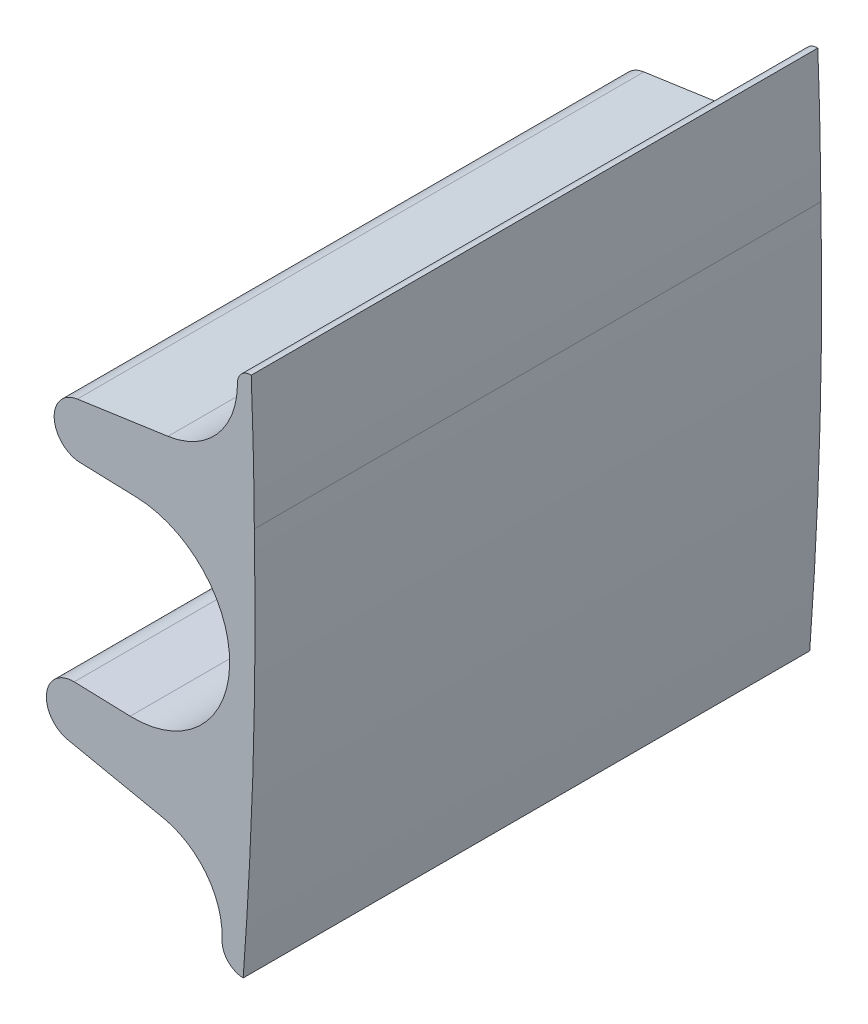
ISO-10303-21;
HEADER;
FILE_DESCRIPTION(('STEP AP214'),'2;1');
FILE_NAME('part.step','',(''),(''),'','','');
FILE_SCHEMA(('AUTOMOTIVE_DESIGN { 1 0 10303 214 1 1 1 1 }'));
ENDSEC;
DATA;
#1=APPLICATION_CONTEXT('core data for automotive mechanical design processes');
#2=APPLICATION_PROTOCOL_DEFINITION('international standard','automotive_design',2000,#1);
#3=PRODUCT_CONTEXT('',#1,'mechanical');
#4=PRODUCT('Part','Part','',(#3));
#5=PRODUCT_RELATED_PRODUCT_CATEGORY('part','',(#4));
#6=PRODUCT_DEFINITION_FORMATION('','',#4);
#7=PRODUCT_DEFINITION_CONTEXT('part definition',#1,'design');
#8=PRODUCT_DEFINITION('design','',#6,#7);
#9=PRODUCT_DEFINITION_SHAPE('','',#8);
#10=(LENGTH_UNIT() NAMED_UNIT(*) SI_UNIT(.MILLI.,.METRE.));
#11=(NAMED_UNIT(*) PLANE_ANGLE_UNIT() SI_UNIT($,.RADIAN.));
#12=(NAMED_UNIT(*) SI_UNIT($,.STERADIAN.) SOLID_ANGLE_UNIT());
#13=UNCERTAINTY_MEASURE_WITH_UNIT(LENGTH_MEASURE(1.E-05),#10,'distance_accuracy_value','');
#14=(GEOMETRIC_REPRESENTATION_CONTEXT(3) GLOBAL_UNCERTAINTY_ASSIGNED_CONTEXT((#13)) GLOBAL_UNIT_ASSIGNED_CONTEXT((#10,
#11,#12)) REPRESENTATION_CONTEXT('',''));
#15=CARTESIAN_POINT('',(0.,0.,0.));
#16=DIRECTION('',(0.,0.,1.));
#17=DIRECTION('',(1.,0.,0.));
#18=AXIS2_PLACEMENT_3D('',#15,#16,#17);
#19=CARTESIAN_POINT('',(89.7962233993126,0.,43.2000000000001));
#20=DIRECTION('',(0.,0.,-1.));
#21=DIRECTION('',(-1.,0.,0.));
#22=AXIS2_PLACEMENT_3D('',#19,#20,#21);
#23=CYLINDRICAL_SURFACE('',#22,7.14999999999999);
#24=CARTESIAN_POINT('',(89.7962233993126,0.,1.20000000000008));
#25=DIRECTION('',(0.,0.,-1.));
#26=DIRECTION('',(1.,0.,0.));
#27=AXIS2_PLACEMENT_3D('',#24,#25,#26);
#28=CIRCLE('',#27,7.14999999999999);
#29=CARTESIAN_POINT('',(90.021600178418,7.14644704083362,1.20000000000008));
#30=VERTEX_POINT('',#29);
#31=CARTESIAN_POINT('',(89.5708466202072,-7.14644704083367,1.20000000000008));
#32=VERTEX_POINT('',#31);
#33=EDGE_CURVE('E177',#30,#32,#28,.T.);
#34=ORIENTED_EDGE('',*,*,#33,.T.);
#35=DIRECTION('',(0.,0.,-1.));
#36=VECTOR('',#35,1.);
#37=CARTESIAN_POINT('',(89.5708466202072,-7.14644704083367,43.2000000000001));
#38=LINE('',#37,#36);
#39=CARTESIAN_POINT('',(89.5708466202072,-7.14644704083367,43.2000000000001));
#40=VERTEX_POINT('',#39);
#41=EDGE_CURVE('E11',#40,#32,#38,.T.);
#42=ORIENTED_EDGE('',*,*,#41,.F.);
#43=CARTESIAN_POINT('',(89.7962233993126,0.,43.2000000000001));
#44=DIRECTION('',(0.,0.,-1.));
#45=DIRECTION('',(1.,0.,0.));
#46=AXIS2_PLACEMENT_3D('',#43,#44,#45);
#47=CIRCLE('',#46,7.14999999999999);
#48=CARTESIAN_POINT('',(90.021600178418,7.14644704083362,43.2000000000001));
#49=VERTEX_POINT('',#48);
#50=EDGE_CURVE('E199',#49,#40,#47,.T.);
#51=ORIENTED_EDGE('',*,*,#50,.F.);
#52=DIRECTION('',(0.,0.,-1.));
#53=VECTOR('',#52,1.);
#54=CARTESIAN_POINT('',(90.021600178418,7.14644704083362,43.2000000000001));
#55=LINE('',#54,#53);
#56=EDGE_CURVE('E173',#49,#30,#55,.T.);
#57=ORIENTED_EDGE('',*,*,#56,.T.);
#58=EDGE_LOOP('',(#34,#42,#51,#57));
#59=FACE_BOUND('',#58,.T.);
#60=ADVANCED_FACE('F37',(#59),#23,.F.);
#61=CARTESIAN_POINT('',(89.5708466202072,-7.14644704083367,43.2000000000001));
#62=DIRECTION('',(-0.0315212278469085,-0.999503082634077,0.));
#63=DIRECTION('',(0.999503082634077,-0.0315212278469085,0.));
#64=AXIS2_PLACEMENT_3D('',#61,#62,#63);
#65=PLANE('',#64);
#66=DIRECTION('',(-0.999503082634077,0.0315212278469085,0.));
#67=VECTOR('',#66,1.);
#68=CARTESIAN_POINT('',(89.5708466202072,-7.14644704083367,1.20000000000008));
#69=LINE('',#68,#67);
#70=CARTESIAN_POINT('',(85.4229088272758,-7.015633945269,1.20000000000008));
#71=VERTEX_POINT('',#70);
#72=EDGE_CURVE('E180',#32,#71,#69,.T.);
#73=ORIENTED_EDGE('',*,*,#72,.T.);
#74=DIRECTION('',(0.,0.,-1.));
#75=VECTOR('',#74,1.);
#76=CARTESIAN_POINT('',(85.4229088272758,-7.015633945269,43.2000000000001));
#77=LINE('',#76,#75);
#78=CARTESIAN_POINT('',(85.4229088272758,-7.015633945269,43.2000000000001));
#79=VERTEX_POINT('',#78);
#80=EDGE_CURVE('E46',#79,#71,#77,.T.);
#81=ORIENTED_EDGE('',*,*,#80,.F.);
#82=DIRECTION('',(-0.999503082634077,0.0315212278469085,0.));
#83=VECTOR('',#82,1.);
#84=CARTESIAN_POINT('',(89.5708466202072,-7.14644704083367,43.2000000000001));
#85=LINE('',#84,#83);
#86=EDGE_CURVE('E119',#40,#79,#85,.T.);
#87=ORIENTED_EDGE('',*,*,#86,.F.);
#88=ORIENTED_EDGE('',*,*,#41,.T.);
#89=EDGE_LOOP('',(#73,#81,#87,#88));
#90=FACE_BOUND('',#89,.T.);
#91=ADVANCED_FACE('F400',(#90),#65,.F.);
#92=CARTESIAN_POINT('',(85.359866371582,-9.01464011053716,43.2000000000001));
#93=DIRECTION('',(0.,0.,-1.));
#94=DIRECTION('',(-1.,0.,0.));
#95=AXIS2_PLACEMENT_3D('',#92,#93,#94);
#96=CYLINDRICAL_SURFACE('',#95,2.);
#97=CARTESIAN_POINT('',(85.359866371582,-9.01464011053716,1.20000000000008));
#98=DIRECTION('',(0.,0.,1.));
#99=DIRECTION('',(1.,0.,0.));
#100=AXIS2_PLACEMENT_3D('',#97,#98,#99);
#101=CIRCLE('',#100,2.);
#102=CARTESIAN_POINT('',(84.950657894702,-10.9723296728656,1.20000000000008));
#103=VERTEX_POINT('',#102);
#104=EDGE_CURVE('E182',#71,#103,#101,.T.);
#105=ORIENTED_EDGE('',*,*,#104,.T.);
#106=DIRECTION('',(0.,0.,-1.));
#107=VECTOR('',#106,1.);
#108=CARTESIAN_POINT('',(84.950657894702,-10.9723296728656,43.2000000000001));
#109=LINE('',#108,#107);
#110=CARTESIAN_POINT('',(84.950657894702,-10.9723296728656,43.2000000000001));
#111=VERTEX_POINT('',#110);
#112=EDGE_CURVE('E220',#111,#103,#109,.T.);
#113=ORIENTED_EDGE('',*,*,#112,.F.);
#114=CARTESIAN_POINT('',(85.359866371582,-9.01464011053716,43.2000000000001));
#115=DIRECTION('',(0.,0.,1.));
#116=DIRECTION('',(1.,0.,0.));
#117=AXIS2_PLACEMENT_3D('',#114,#115,#116);
#118=CIRCLE('',#117,2.);
#119=EDGE_CURVE('E433',#79,#111,#118,.T.);
#120=ORIENTED_EDGE('',*,*,#119,.F.);
#121=ORIENTED_EDGE('',*,*,#80,.T.);
#122=EDGE_LOOP('',(#105,#113,#120,#121));
#123=FACE_BOUND('',#122,.T.);
#124=ADVANCED_FACE('F404',(#123),#96,.T.);
#125=CARTESIAN_POINT('',(84.950657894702,-10.9723296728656,43.2000000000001));
#126=DIRECTION('',(0.204604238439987,0.978844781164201,0.));
#127=DIRECTION('',(-0.978844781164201,0.204604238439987,0.));
#128=AXIS2_PLACEMENT_3D('',#125,#126,#127);
#129=PLANE('',#128);
#130=DIRECTION('',(0.978844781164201,-0.204604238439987,0.));
#131=VECTOR('',#130,1.);
#132=CARTESIAN_POINT('',(84.950657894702,-10.9723296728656,1.20000000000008));
#133=LINE('',#132,#131);
#134=CARTESIAN_POINT('',(92.0100147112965,-12.4479204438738,1.20000000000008));
#135=VERTEX_POINT('',#134);
#136=EDGE_CURVE('E184',#103,#135,#133,.T.);
#137=ORIENTED_EDGE('',*,*,#136,.T.);
#138=DIRECTION('',(0.,0.,-1.));
#139=VECTOR('',#138,1.);
#140=CARTESIAN_POINT('',(92.0100147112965,-12.4479204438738,43.2000000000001));
#141=LINE('',#140,#139);
#142=CARTESIAN_POINT('',(92.0100147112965,-12.4479204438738,43.2000000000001));
#143=VERTEX_POINT('',#142);
#144=EDGE_CURVE('E217',#143,#135,#141,.T.);
#145=ORIENTED_EDGE('',*,*,#144,.F.);
#146=DIRECTION('',(0.978844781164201,-0.204604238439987,0.));
#147=VECTOR('',#146,1.);
#148=CARTESIAN_POINT('',(84.950657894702,-10.9723296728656,43.2000000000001));
#149=LINE('',#148,#147);
#150=EDGE_CURVE('E431',#111,#143,#149,.T.);
#151=ORIENTED_EDGE('',*,*,#150,.F.);
#152=ORIENTED_EDGE('',*,*,#112,.T.);
#153=EDGE_LOOP('',(#137,#145,#151,#152));
#154=FACE_BOUND('',#153,.T.);
#155=ADVANCED_FACE('F408',(#154),#129,.F.);
#156=CARTESIAN_POINT('',(90.8846913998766,-17.8315667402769,43.2000000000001));
#157=DIRECTION('',(0.,0.,-1.));
#158=DIRECTION('',(-1.,0.,0.));
#159=AXIS2_PLACEMENT_3D('',#156,#157,#158);
#160=CYLINDRICAL_SURFACE('',#159,5.49999999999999);
#161=CARTESIAN_POINT('',(90.8846913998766,-17.8315667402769,1.20000000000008));
#162=DIRECTION('',(0.,0.,-1.));
#163=DIRECTION('',(1.,0.,0.));
#164=AXIS2_PLACEMENT_3D('',#161,#162,#163);
#165=CIRCLE('',#164,5.49999999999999);
#166=CARTESIAN_POINT('',(96.381958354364,-18.0049334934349,1.20000000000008));
#167=VERTEX_POINT('',#166);
#168=EDGE_CURVE('E186',#135,#167,#165,.T.);
#169=ORIENTED_EDGE('',*,*,#168,.T.);
#170=DIRECTION('',(0.,0.,-1.));
#171=VECTOR('',#170,1.);
#172=CARTESIAN_POINT('',(96.381958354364,-18.0049334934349,43.2000000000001));
#173=LINE('',#172,#171);
#174=CARTESIAN_POINT('',(96.381958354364,-18.0049334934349,43.2000000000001));
#175=VERTEX_POINT('',#174);
#176=EDGE_CURVE('E213',#175,#167,#173,.T.);
#177=ORIENTED_EDGE('',*,*,#176,.F.);
#178=CARTESIAN_POINT('',(90.8846913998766,-17.8315667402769,43.2000000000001));
#179=DIRECTION('',(0.,0.,-1.));
#180=DIRECTION('',(1.,0.,0.));
#181=AXIS2_PLACEMENT_3D('',#178,#179,#180);
#182=CIRCLE('',#181,5.49999999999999);
#183=EDGE_CURVE('E430',#143,#175,#182,.T.);
#184=ORIENTED_EDGE('',*,*,#183,.F.);
#185=ORIENTED_EDGE('',*,*,#144,.T.);
#186=EDGE_LOOP('',(#169,#177,#184,#185));
#187=FACE_BOUND('',#186,.T.);
#188=ADVANCED_FACE('F414',(#187),#160,.F.);
#189=CARTESIAN_POINT('',(96.381958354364,-18.0049334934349,43.2000000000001));
#190=DIRECTION('',(0.999503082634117,-0.0315212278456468,0.));
#191=DIRECTION('',(0.0315212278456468,0.999503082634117,0.));
#192=AXIS2_PLACEMENT_3D('',#189,#190,#191);
#193=PLANE('',#192);
#194=DIRECTION('',(-0.0315212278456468,-0.999503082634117,0.));
#195=VECTOR('',#194,1.);
#196=CARTESIAN_POINT('',(96.381958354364,-18.0049334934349,1.20000000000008));
#197=LINE('',#196,#195);
#198=CARTESIAN_POINT('',(96.3790821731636,-18.0961340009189,1.20000000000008));
#199=VERTEX_POINT('',#198);
#200=EDGE_CURVE('E188',#167,#199,#197,.T.);
#201=ORIENTED_EDGE('',*,*,#200,.T.);
#202=DIRECTION('',(0.,0.,-1.));
#203=VECTOR('',#202,1.);
#204=CARTESIAN_POINT('',(96.3790821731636,-18.0961340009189,43.2000000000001));
#205=LINE('',#204,#203);
#206=CARTESIAN_POINT('',(96.3790821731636,-18.0961340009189,43.2000000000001));
#207=VERTEX_POINT('',#206);
#208=EDGE_CURVE('E210',#207,#199,#205,.T.);
#209=ORIENTED_EDGE('',*,*,#208,.F.);
#210=DIRECTION('',(-0.0315212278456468,-0.999503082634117,0.));
#211=VECTOR('',#210,1.);
#212=CARTESIAN_POINT('',(96.381958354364,-18.0049334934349,43.2000000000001));
#213=LINE('',#212,#211);
#214=EDGE_CURVE('E292',#175,#207,#213,.T.);
#215=ORIENTED_EDGE('',*,*,#214,.F.);
#216=ORIENTED_EDGE('',*,*,#176,.T.);
#217=EDGE_LOOP('',(#201,#209,#215,#216));
#218=FACE_BOUND('',#217,.T.);
#219=ADVANCED_FACE('F417',(#218),#193,.F.);
#220=CARTESIAN_POINT('',(97.9986350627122,-18.1472096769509,43.2000000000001));
#221=DIRECTION('',(0.,0.,-1.));
#222=DIRECTION('',(-1.,0.,0.));
#223=AXIS2_PLACEMENT_3D('',#220,#221,#222);
#224=CYLINDRICAL_SURFACE('',#223,1.62035807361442);
#225=CARTESIAN_POINT('',(97.9986350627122,-18.1472096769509,1.20000000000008));
#226=DIRECTION('',(0.,0.,1.));
#227=DIRECTION('',(1.,0.,0.));
#228=AXIS2_PLACEMENT_3D('',#225,#226,#227);
#229=CIRCLE('',#228,1.62035807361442);
#230=CARTESIAN_POINT('',(97.9475593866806,-19.7667625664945,1.20000000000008));
#231=VERTEX_POINT('',#230);
#232=EDGE_CURVE('E190',#199,#231,#229,.T.);
#233=ORIENTED_EDGE('',*,*,#232,.T.);
#234=DIRECTION('',(0.,0.,-1.));
#235=VECTOR('',#234,1.);
#236=CARTESIAN_POINT('',(97.9475593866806,-19.7667625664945,43.2000000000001));
#237=LINE('',#236,#235);
#238=CARTESIAN_POINT('',(97.9475593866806,-19.7667625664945,43.2000000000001));
#239=VERTEX_POINT('',#238);
#240=EDGE_CURVE('E214',#239,#231,#237,.T.);
#241=ORIENTED_EDGE('',*,*,#240,.F.);
#242=CARTESIAN_POINT('',(97.9986350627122,-18.1472096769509,43.2000000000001));
#243=DIRECTION('',(0.,0.,1.));
#244=DIRECTION('',(1.,0.,0.));
#245=AXIS2_PLACEMENT_3D('',#242,#243,#244);
#246=CIRCLE('',#245,1.62035807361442);
#247=EDGE_CURVE('E268',#207,#239,#246,.T.);
#248=ORIENTED_EDGE('',*,*,#247,.F.);
#249=ORIENTED_EDGE('',*,*,#208,.T.);
#250=EDGE_LOOP('',(#233,#241,#248,#249));
#251=FACE_BOUND('',#250,.T.);
#252=ADVANCED_FACE('F282',(#251),#224,.T.);
#253=CARTESIAN_POINT('',(97.9475593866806,-19.7667625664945,43.2000000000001));
#254=CARTESIAN_POINT('',(98.6761779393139,-9.90365087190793,43.2000000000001));
#255=CARTESIAN_POINT('',(98.9629919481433,-0.145944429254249,43.2000000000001));
#256=CARTESIAN_POINT('',(98.7734524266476,9.47571701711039,43.2000000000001));
#257=B_SPLINE_CURVE_WITH_KNOTS('',3,(#253,#254,#255,#256),.UNSPECIFIED.,.F.,.F.,(4,4),
(0.85774743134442,1.00003053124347),.UNSPECIFIED.);
#258=DIRECTION('',(0.,0.,-1.));
#259=VECTOR('',#258,1.);
#260=SURFACE_OF_LINEAR_EXTRUSION('',#257,#259);
#261=CARTESIAN_POINT('',(97.9475593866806,-19.7667625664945,1.20000000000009));
#262=CARTESIAN_POINT('',(98.6761779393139,-9.90365087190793,1.20000000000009));
#263=CARTESIAN_POINT('',(98.9629919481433,-0.145944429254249,1.20000000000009));
#264=CARTESIAN_POINT('',(98.7734524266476,9.47571701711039,1.20000000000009));
#265=B_SPLINE_CURVE_WITH_KNOTS('',3,(#261,#262,#263,#264),.UNSPECIFIED.,.F.,.F.,(4,4),
(0.85774743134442,1.00003053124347),.UNSPECIFIED.);
#266=CARTESIAN_POINT('',(98.7734524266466,9.47571701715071,1.20000000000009));
#267=VERTEX_POINT('',#266);
#268=EDGE_CURVE('E345',#231,#267,#265,.T.);
#269=ORIENTED_EDGE('',*,*,#268,.T.);
#270=DIRECTION('',(0.,0.,-1.));
#271=VECTOR('',#270,1.);
#272=CARTESIAN_POINT('',(98.7734524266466,9.47571701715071,43.2000000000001));
#273=LINE('',#272,#271);
#274=CARTESIAN_POINT('',(98.7734524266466,9.47571701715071,43.2000000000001));
#275=VERTEX_POINT('',#274);
#276=EDGE_CURVE('E370',#275,#267,#273,.T.);
#277=ORIENTED_EDGE('',*,*,#276,.F.);
#278=CARTESIAN_POINT('',(98.7734524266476,9.47571701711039,43.2000000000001));
#279=CARTESIAN_POINT('',(98.9629919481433,-0.145944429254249,43.2000000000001));
#280=CARTESIAN_POINT('',(98.6761779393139,-9.90365087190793,43.2000000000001));
#281=CARTESIAN_POINT('',(97.9475593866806,-19.7667625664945,43.2000000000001));
#282=B_SPLINE_CURVE_WITH_KNOTS('',3,(#278,#279,#280,#281),.UNSPECIFIED.,.F.,.F.,(4,4),
(0.85774743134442,1.00003053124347),.UNSPECIFIED.);
#283=EDGE_CURVE('E263',#239,#275,#282,.F.);
#284=ORIENTED_EDGE('',*,*,#283,.F.);
#285=ORIENTED_EDGE('',*,*,#240,.T.);
#286=EDGE_LOOP('',(#269,#277,#284,#285));
#287=FACE_BOUND('',#286,.T.);
#288=ADVANCED_FACE('F270',(#287),#260,.F.);
#289=CARTESIAN_POINT('',(-1523.89946673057,-1118.33947810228,43.2000000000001));
#290=CARTESIAN_POINT('',(-8.88026063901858,-446.682805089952,43.2000000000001));
#291=CARTESIAN_POINT('',(140.772512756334,-157.890507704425,43.2000000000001));
#292=CARTESIAN_POINT('',(25.9107580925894,386.012962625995,43.2000000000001));
#293=CARTESIAN_POINT('',(-380.003107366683,603.436541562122,43.2000000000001));
#294=CARTESIAN_POINT('',(1484.80099931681,1449.73424216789,43.2000000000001));
#295=B_SPLINE_CURVE_WITH_KNOTS('',3,(#289,#290,#291,#292,#293,#294),.UNSPECIFIED.,.F.,.F.,(4,2,
4),(-4.80301190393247,0.5,7.43186053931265),.UNSPECIFIED.);
#296=DIRECTION('',(0.,0.,-1.));
#297=VECTOR('',#296,1.);
#298=SURFACE_OF_LINEAR_EXTRUSION('',#295,#297);
#299=CARTESIAN_POINT('',(98.7734524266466,9.47571701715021,1.2000000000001));
#300=CARTESIAN_POINT('',(98.7497198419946,12.7426823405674,1.2000000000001));
#301=CARTESIAN_POINT('',(98.6725938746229,15.9951255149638,1.2000000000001));
#302=CARTESIAN_POINT('',(98.5447179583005,19.2337943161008,1.2000000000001));
#303=B_SPLINE_CURVE_WITH_KNOTS('',3,(#299,#300,#301,#302),.UNSPECIFIED.,.F.,.F.,(4,4),
(-4.40368588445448E-05,0.0696220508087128),.UNSPECIFIED.);
#304=CARTESIAN_POINT('',(98.5447179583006,19.2337943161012,1.20000000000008));
#305=VERTEX_POINT('',#304);
#306=EDGE_CURVE('E321',#267,#305,#303,.T.);
#307=ORIENTED_EDGE('',*,*,#306,.T.);
#308=DIRECTION('',(0.,0.,-1.));
#309=VECTOR('',#308,1.);
#310=CARTESIAN_POINT('',(98.5447179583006,19.2337943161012,43.2000000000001));
#311=LINE('',#310,#309);
#312=CARTESIAN_POINT('',(98.5447179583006,19.2337943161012,43.2000000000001));
#313=VERTEX_POINT('',#312);
#314=EDGE_CURVE('E209',#313,#305,#311,.T.);
#315=ORIENTED_EDGE('',*,*,#314,.F.);
#316=CARTESIAN_POINT('',(98.5447179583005,19.2337943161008,43.2000000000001));
#317=CARTESIAN_POINT('',(98.6725938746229,15.9951255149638,43.2000000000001));
#318=CARTESIAN_POINT('',(98.7497198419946,12.7426823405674,43.2000000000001));
#319=CARTESIAN_POINT('',(98.7734524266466,9.47571701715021,43.2000000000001));
#320=B_SPLINE_CURVE_WITH_KNOTS('',3,(#316,#317,#318,#319),.UNSPECIFIED.,.F.,.F.,(4,4),
(-4.40368588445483E-05,0.0696220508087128),.UNSPECIFIED.);
#321=EDGE_CURVE('E227',#275,#313,#320,.F.);
#322=ORIENTED_EDGE('',*,*,#321,.F.);
#323=ORIENTED_EDGE('',*,*,#276,.T.);
#324=EDGE_LOOP('',(#307,#315,#322,#323));
#325=FACE_BOUND('',#324,.T.);
#326=ADVANCED_FACE('F281',(#325),#298,.F.);
#327=CARTESIAN_POINT('',(98.5135789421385,18.2464107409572,43.2000000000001));
#328=DIRECTION('',(0.,0.,-1.));
#329=DIRECTION('',(-1.,0.,0.));
#330=AXIS2_PLACEMENT_3D('',#327,#328,#329);
#331=CYLINDRICAL_SURFACE('',#330,0.987874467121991);
#332=CARTESIAN_POINT('',(98.5135789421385,18.2464107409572,1.20000000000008));
#333=DIRECTION('',(0.,0.,1.));
#334=DIRECTION('',(1.,0.,0.));
#335=AXIS2_PLACEMENT_3D('',#332,#333,#334);
#336=CIRCLE('',#335,0.987874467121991);
#337=CARTESIAN_POINT('',(97.5261953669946,18.2775497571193,1.20000000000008));
#338=VERTEX_POINT('',#337);
#339=EDGE_CURVE('E194',#305,#338,#336,.T.);
#340=ORIENTED_EDGE('',*,*,#339,.T.);
#341=DIRECTION('',(0.,0.,-1.));
#342=VECTOR('',#341,1.);
#343=CARTESIAN_POINT('',(97.5261953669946,18.2775497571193,43.2000000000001));
#344=LINE('',#343,#342);
#345=CARTESIAN_POINT('',(97.5261953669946,18.2775497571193,43.2000000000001));
#346=VERTEX_POINT('',#345);
#347=EDGE_CURVE('E206',#346,#338,#344,.T.);
#348=ORIENTED_EDGE('',*,*,#347,.F.);
#349=CARTESIAN_POINT('',(98.5135789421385,18.2464107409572,43.2000000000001));
#350=DIRECTION('',(0.,0.,1.));
#351=DIRECTION('',(1.,0.,0.));
#352=AXIS2_PLACEMENT_3D('',#349,#350,#351);
#353=CIRCLE('',#352,0.987874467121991);
#354=EDGE_CURVE('E305',#313,#346,#353,.T.);
#355=ORIENTED_EDGE('',*,*,#354,.F.);
#356=ORIENTED_EDGE('',*,*,#314,.T.);
#357=EDGE_LOOP('',(#340,#348,#355,#356));
#358=FACE_BOUND('',#357,.T.);
#359=ADVANCED_FACE('F382',(#358),#331,.T.);
#360=CARTESIAN_POINT('',(97.5261953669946,18.2775497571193,43.2000000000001));
#361=DIRECTION('',(0.999503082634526,-0.0315212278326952,0.));
#362=DIRECTION('',(0.0315212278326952,0.999503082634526,0.));
#363=AXIS2_PLACEMENT_3D('',#360,#361,#362);
#364=PLANE('',#363);
#365=DIRECTION('',(-0.0315212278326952,-0.999503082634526,0.));
#366=VECTOR('',#365,1.);
#367=CARTESIAN_POINT('',(97.5261953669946,18.2775497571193,1.20000000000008));
#368=LINE('',#367,#366);
#369=CARTESIAN_POINT('',(97.5166072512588,17.9735212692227,1.20000000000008));
#370=VERTEX_POINT('',#369);
#371=EDGE_CURVE('E191',#338,#370,#368,.T.);
#372=ORIENTED_EDGE('',*,*,#371,.T.);
#373=DIRECTION('',(0.,0.,-1.));
#374=VECTOR('',#373,1.);
#375=CARTESIAN_POINT('',(97.5166072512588,17.9735212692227,43.2000000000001));
#376=LINE('',#375,#374);
#377=CARTESIAN_POINT('',(97.5166072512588,17.9735212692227,43.2000000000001));
#378=VERTEX_POINT('',#377);
#379=EDGE_CURVE('E203',#378,#370,#376,.T.);
#380=ORIENTED_EDGE('',*,*,#379,.F.);
#381=DIRECTION('',(-0.0315212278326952,-0.999503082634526,0.));
#382=VECTOR('',#381,1.);
#383=CARTESIAN_POINT('',(97.5261953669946,18.2775497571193,43.2000000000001));
#384=LINE('',#383,#382);
#385=EDGE_CURVE('E301',#346,#378,#384,.T.);
#386=ORIENTED_EDGE('',*,*,#385,.F.);
#387=ORIENTED_EDGE('',*,*,#347,.T.);
#388=EDGE_LOOP('',(#372,#380,#386,#387));
#389=FACE_BOUND('',#388,.T.);
#390=ADVANCED_FACE('F387',(#389),#364,.F.);
#391=CARTESIAN_POINT('',(91.5195887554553,18.1626486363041,43.2000000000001));
#392=DIRECTION('',(0.,0.,-1.));
#393=DIRECTION('',(-1.,0.,0.));
#394=AXIS2_PLACEMENT_3D('',#391,#392,#393);
#395=CYLINDRICAL_SURFACE('',#394,5.99999999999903);
#396=CARTESIAN_POINT('',(91.5195887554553,18.1626486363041,1.20000000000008));
#397=DIRECTION('',(0.,0.,-1.));
#398=DIRECTION('',(1.,0.,0.));
#399=AXIS2_PLACEMENT_3D('',#396,#397,#398);
#400=CIRCLE('',#399,5.99999999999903);
#401=CARTESIAN_POINT('',(92.3747059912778,12.2238967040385,1.20000000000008));
#402=VERTEX_POINT('',#401);
#403=EDGE_CURVE('E193',#370,#402,#400,.T.);
#404=ORIENTED_EDGE('',*,*,#403,.T.);
#405=DIRECTION('',(0.,0.,-1.));
#406=VECTOR('',#405,1.);
#407=CARTESIAN_POINT('',(92.3747059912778,12.2238967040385,43.2000000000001));
#408=LINE('',#407,#406);
#409=CARTESIAN_POINT('',(92.3747059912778,12.2238967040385,43.2000000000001));
#410=VERTEX_POINT('',#409);
#411=EDGE_CURVE('E168',#410,#402,#408,.T.);
#412=ORIENTED_EDGE('',*,*,#411,.F.);
#413=CARTESIAN_POINT('',(91.5195887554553,18.1626486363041,43.2000000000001));
#414=DIRECTION('',(0.,0.,-1.));
#415=DIRECTION('',(1.,0.,0.));
#416=AXIS2_PLACEMENT_3D('',#413,#414,#415);
#417=CIRCLE('',#416,5.99999999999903);
#418=EDGE_CURVE('E159',#378,#410,#417,.T.);
#419=ORIENTED_EDGE('',*,*,#418,.F.);
#420=ORIENTED_EDGE('',*,*,#379,.T.);
#421=EDGE_LOOP('',(#404,#412,#419,#420));
#422=FACE_BOUND('',#421,.T.);
#423=ADVANCED_FACE('F389',(#422),#395,.F.);
#424=CARTESIAN_POINT('',(85.6516657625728,11.2558502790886,43.2000000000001));
#425=DIRECTION('',(0.142519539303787,-0.989791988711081,0.));
#426=DIRECTION('',(0.989791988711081,0.142519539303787,0.));
#427=AXIS2_PLACEMENT_3D('',#424,#425,#426);
#428=PLANE('',#427);
#429=DIRECTION('',(-0.989791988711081,-0.142519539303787,0.));
#430=VECTOR('',#429,1.);
#431=CARTESIAN_POINT('',(85.6516657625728,11.2558502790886,1.20000000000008));
#432=LINE('',#431,#430);
#433=CARTESIAN_POINT('',(85.6516657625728,11.2558502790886,1.20000000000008));
#434=VERTEX_POINT('',#433);
#435=EDGE_CURVE('E167',#402,#434,#432,.T.);
#436=ORIENTED_EDGE('',*,*,#435,.T.);
#437=DIRECTION('',(0.,0.,-1.));
#438=VECTOR('',#437,1.);
#439=CARTESIAN_POINT('',(85.6516657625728,11.2558502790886,43.2000000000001));
#440=LINE('',#439,#438);
#441=CARTESIAN_POINT('',(85.6516657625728,11.2558502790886,43.2000000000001));
#442=VERTEX_POINT('',#441);
#443=EDGE_CURVE('E164',#442,#434,#440,.T.);
#444=ORIENTED_EDGE('',*,*,#443,.F.);
#445=DIRECTION('',(-0.989791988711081,-0.142519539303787,0.));
#446=VECTOR('',#445,1.);
#447=CARTESIAN_POINT('',(85.6516657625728,11.2558502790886,43.2000000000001));
#448=LINE('',#447,#446);
#449=EDGE_CURVE('E153',#410,#442,#448,.T.);
#450=ORIENTED_EDGE('',*,*,#449,.F.);
#451=ORIENTED_EDGE('',*,*,#411,.T.);
#452=EDGE_LOOP('',(#436,#444,#450,#451));
#453=FACE_BOUND('',#452,.T.);
#454=ADVANCED_FACE('F165',(#453),#428,.F.);
#455=CARTESIAN_POINT('',(85.9367048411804,9.27626630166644,43.2000000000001));
#456=DIRECTION('',(0.,0.,-1.));
#457=DIRECTION('',(-1.,0.,0.));
#458=AXIS2_PLACEMENT_3D('',#455,#456,#457);
#459=CYLINDRICAL_SURFACE('',#458,2.);
#460=CARTESIAN_POINT('',(85.9367048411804,9.27626630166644,1.20000000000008));
#461=DIRECTION('',(0.,0.,1.));
#462=DIRECTION('',(1.,0.,0.));
#463=AXIS2_PLACEMENT_3D('',#460,#461,#462);
#464=CIRCLE('',#463,2.);
#465=CARTESIAN_POINT('',(85.8736623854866,7.27726013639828,1.20000000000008));
#466=VERTEX_POINT('',#465);
#467=EDGE_CURVE('E105',#434,#466,#464,.T.);
#468=ORIENTED_EDGE('',*,*,#467,.T.);
#469=DIRECTION('',(0.,0.,-1.));
#470=VECTOR('',#469,1.);
#471=CARTESIAN_POINT('',(85.8736623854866,7.27726013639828,43.2000000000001));
#472=LINE('',#471,#470);
#473=CARTESIAN_POINT('',(85.8736623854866,7.27726013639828,43.2000000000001));
#474=VERTEX_POINT('',#473);
#475=EDGE_CURVE('E169',#474,#466,#472,.T.);
#476=ORIENTED_EDGE('',*,*,#475,.F.);
#477=CARTESIAN_POINT('',(85.9367048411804,9.27626630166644,43.2000000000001));
#478=DIRECTION('',(0.,0.,1.));
#479=DIRECTION('',(1.,0.,0.));
#480=AXIS2_PLACEMENT_3D('',#477,#478,#479);
#481=CIRCLE('',#480,2.);
#482=EDGE_CURVE('E157',#442,#474,#481,.T.);
#483=ORIENTED_EDGE('',*,*,#482,.F.);
#484=ORIENTED_EDGE('',*,*,#443,.T.);
#485=EDGE_LOOP('',(#468,#476,#483,#484));
#486=FACE_BOUND('',#485,.T.);
#487=ADVANCED_FACE('F171',(#486),#459,.T.);
#488=CARTESIAN_POINT('',(85.8736623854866,7.27726013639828,43.2000000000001));
#489=DIRECTION('',(0.031521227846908,0.999503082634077,0.));
#490=DIRECTION('',(-0.999503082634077,0.031521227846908,0.));
#491=AXIS2_PLACEMENT_3D('',#488,#489,#490);
#492=PLANE('',#491);
#493=DIRECTION('',(0.999503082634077,-0.031521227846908,0.));
#494=VECTOR('',#493,1.);
#495=CARTESIAN_POINT('',(85.8736623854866,7.27726013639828,1.20000000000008));
#496=LINE('',#495,#494);
#497=EDGE_CURVE('E111',#466,#30,#496,.T.);
#498=ORIENTED_EDGE('',*,*,#497,.T.);
#499=ORIENTED_EDGE('',*,*,#56,.F.);
#500=DIRECTION('',(0.999503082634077,-0.031521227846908,0.));
#501=VECTOR('',#500,1.);
#502=CARTESIAN_POINT('',(85.8736623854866,7.27726013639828,43.2000000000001));
#503=LINE('',#502,#501);
#504=EDGE_CURVE('E55',#474,#49,#503,.T.);
#505=ORIENTED_EDGE('',*,*,#504,.F.);
#506=ORIENTED_EDGE('',*,*,#475,.T.);
#507=EDGE_LOOP('',(#498,#499,#505,#506));
#508=FACE_BOUND('',#507,.T.);
#509=ADVANCED_FACE('F243',(#508),#492,.F.);
#510=CARTESIAN_POINT('',(89.7962233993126,0.,43.2000000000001));
#511=DIRECTION('',(0.,0.,1.));
#512=DIRECTION('',(1.,0.,0.));
#513=AXIS2_PLACEMENT_3D('',#510,#511,#512);
#514=PLANE('',#513);
#515=ORIENTED_EDGE('',*,*,#50,.T.);
#516=ORIENTED_EDGE('',*,*,#86,.T.);
#517=ORIENTED_EDGE('',*,*,#119,.T.);
#518=ORIENTED_EDGE('',*,*,#150,.T.);
#519=ORIENTED_EDGE('',*,*,#183,.T.);
#520=ORIENTED_EDGE('',*,*,#214,.T.);
#521=ORIENTED_EDGE('',*,*,#247,.T.);
#522=ORIENTED_EDGE('',*,*,#283,.T.);
#523=ORIENTED_EDGE('',*,*,#321,.T.);
#524=ORIENTED_EDGE('',*,*,#354,.T.);
#525=ORIENTED_EDGE('',*,*,#385,.T.);
#526=ORIENTED_EDGE('',*,*,#418,.T.);
#527=ORIENTED_EDGE('',*,*,#449,.T.);
#528=ORIENTED_EDGE('',*,*,#482,.T.);
#529=ORIENTED_EDGE('',*,*,#504,.T.);
#530=EDGE_LOOP('',(#515,#516,#517,#518,#519,#520,#521,#522,#523,#524,#525,#526,#527,#528,#529));
#531=FACE_BOUND('',#530,.T.);
#532=ADVANCED_FACE('F155',(#531),#514,.T.);
#533=CARTESIAN_POINT('',(89.7962233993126,0.,1.20000000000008));
#534=DIRECTION('',(0.,0.,1.));
#535=DIRECTION('',(1.,0.,0.));
#536=AXIS2_PLACEMENT_3D('',#533,#534,#535);
#537=PLANE('',#536);
#538=ORIENTED_EDGE('',*,*,#33,.F.);
#539=ORIENTED_EDGE('',*,*,#497,.F.);
#540=ORIENTED_EDGE('',*,*,#467,.F.);
#541=ORIENTED_EDGE('',*,*,#435,.F.);
#542=ORIENTED_EDGE('',*,*,#403,.F.);
#543=ORIENTED_EDGE('',*,*,#371,.F.);
#544=ORIENTED_EDGE('',*,*,#339,.F.);
#545=ORIENTED_EDGE('',*,*,#306,.F.);
#546=ORIENTED_EDGE('',*,*,#268,.F.);
#547=ORIENTED_EDGE('',*,*,#232,.F.);
#548=ORIENTED_EDGE('',*,*,#200,.F.);
#549=ORIENTED_EDGE('',*,*,#168,.F.);
#550=ORIENTED_EDGE('',*,*,#136,.F.);
#551=ORIENTED_EDGE('',*,*,#104,.F.);
#552=ORIENTED_EDGE('',*,*,#72,.F.);
#553=EDGE_LOOP('',(#538,#539,#540,#541,#542,#543,#544,#545,#546,#547,#548,#549,#550,#551,#552));
#554=FACE_BOUND('',#553,.T.);
#555=ADVANCED_FACE('F242',(#554),#537,.F.);
#556=CLOSED_SHELL('',(#60,#91,#124,#155,#188,#219,#252,#288,#326,#359,#390,#423,#454,#487,#509,
#532,#555));
#557=MANIFOLD_SOLID_BREP('B2',#556);
#558=ADVANCED_BREP_SHAPE_REPRESENTATION('',(#18,#557),#14);
#559=SHAPE_DEFINITION_REPRESENTATION(#9,#558);
ENDSEC;
END-ISO-10303-21;
